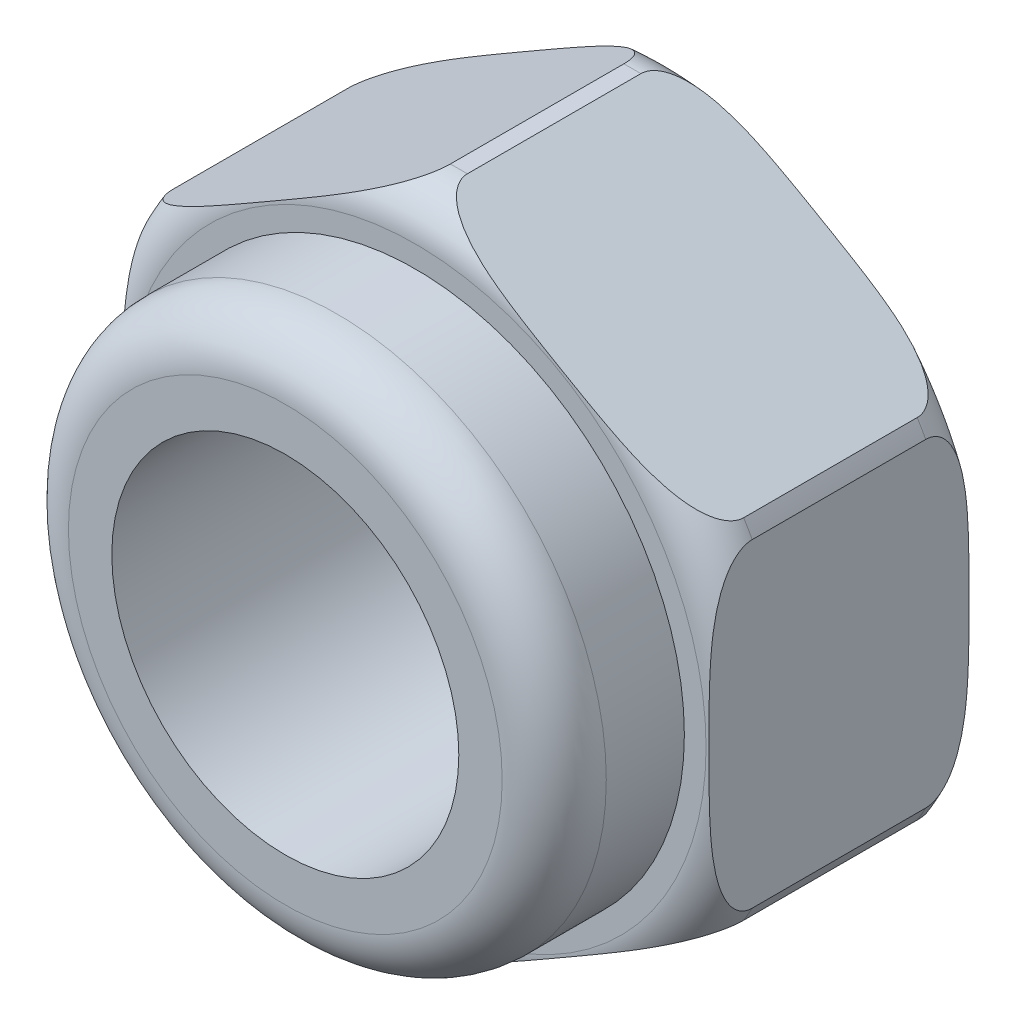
from build123d import *

# Parameters (mm, degrees)
ESQUISSE1_R             = 3.85
ESQUISSE1_R_2           = 2
EXTRUSION1_DEPTH        = 3
CONG_1_R                = 0.5
ESQUISSE2_OUTSIDE_W     = 11.96
ESQUISSE2_OUTSIDE_H     = 11.96
ENL_V_MAT_EXTRU_1_DEPTH = 3
CHANFREIN1_SIZE         = 0.2
ESQUISSE3_R             = 3.1
ESQUISSE3_R_2           = 2
BOSS_EXTRU_1_DEPTH      = 1.5
CONG_2_R                = 0.6


with BuildPart() as part:
    # Esquisse1 → Extrusion1 (new body)
    with BuildSketch(Plane.XY):
        Circle(ESQUISSE1_R)
        Circle(ESQUISSE1_R_2, mode=Mode.SUBTRACT)
    extrude(amount=EXTRUSION1_DEPTH)

    # Cong_1
    cong_1_edges = [part.edges().sort_by_distance(p)[0] for p in [
        (-3.85, 0, 0),
        (-3.85, 0, 3),
    ]]
    fillet(cong_1_edges, radius=CONG_1_R)

    # Esquisse2 outside → Enl_v. mat.-Extru.1 (cut)
    with BuildSketch(Plane.XY.offset(3)):
        Rectangle(ESQUISSE2_OUTSIDE_W, ESQUISSE2_OUTSIDE_H)
        Polygon((3.38209884, 1.952655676), (0, 3.905311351), (-3.38209884, 1.952655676), (-3.38209884, -1.952655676), (0, -3.905311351), (3.38209884, -1.952655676), align=None, mode=Mode.SUBTRACT)
    extrude(amount=-ENL_V_MAT_EXTRU_1_DEPTH, mode=Mode.SUBTRACT)

    # Chanfrein1
    chanfrein1_edges = [part.edges().sort_by_distance(p)[0] for p in [
        (-2, 0, 0),
    ]]
    chamfer(chanfrein1_edges, length=CHANFREIN1_SIZE)

    # Esquisse3 → Boss.-Extru.1 (add)
    with BuildSketch(Plane.XY.offset(3)):
        Circle(ESQUISSE3_R)
        with Locations(Location((0, 0, 0), (0, 0, 180))):
            Circle(ESQUISSE3_R_2, mode=Mode.SUBTRACT)
    extrude(amount=BOSS_EXTRU_1_DEPTH)

    # Cong_2
    cong_2_edges = [part.edges().sort_by_distance(p)[0] for p in [
        (-3.1, 0, 4.5),
    ]]
    fillet(cong_2_edges, radius=CONG_2_R)


solid = part.part
